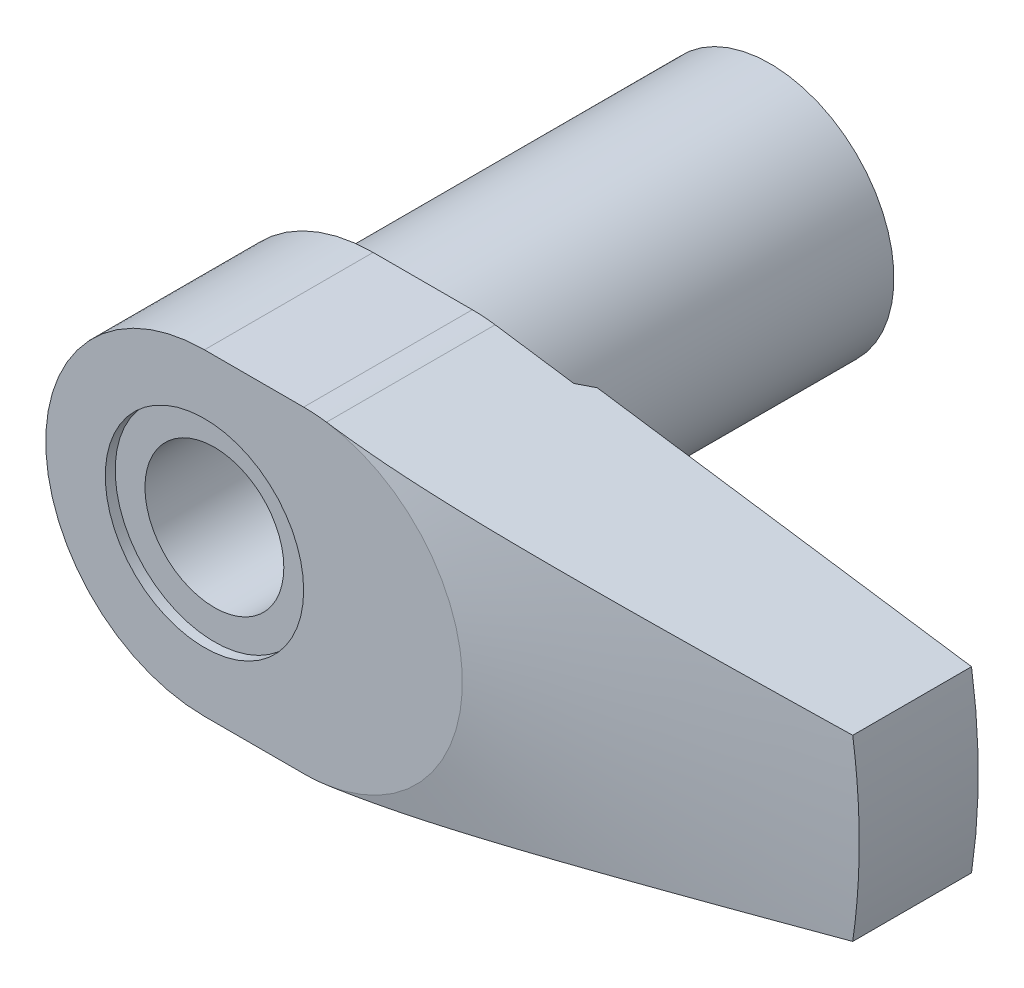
ISO-10303-21;
HEADER;
FILE_DESCRIPTION(('STEP AP214'),'2;1');
FILE_NAME('part.step','',(''),(''),'','','');
FILE_SCHEMA(('AUTOMOTIVE_DESIGN { 1 0 10303 214 1 1 1 1 }'));
ENDSEC;
DATA;
#1=APPLICATION_CONTEXT('core data for automotive mechanical design processes');
#2=APPLICATION_PROTOCOL_DEFINITION('international standard','automotive_design',2000,#1);
#3=PRODUCT_CONTEXT('',#1,'mechanical');
#4=PRODUCT('Part','Part','',(#3));
#5=PRODUCT_RELATED_PRODUCT_CATEGORY('part','',(#4));
#6=PRODUCT_DEFINITION_FORMATION('','',#4);
#7=PRODUCT_DEFINITION_CONTEXT('part definition',#1,'design');
#8=PRODUCT_DEFINITION('design','',#6,#7);
#9=PRODUCT_DEFINITION_SHAPE('','',#8);
#10=(LENGTH_UNIT() NAMED_UNIT(*) SI_UNIT(.MILLI.,.METRE.));
#11=(NAMED_UNIT(*) PLANE_ANGLE_UNIT() SI_UNIT($,.RADIAN.));
#12=(NAMED_UNIT(*) SI_UNIT($,.STERADIAN.) SOLID_ANGLE_UNIT());
#13=UNCERTAINTY_MEASURE_WITH_UNIT(LENGTH_MEASURE(1.E-05),#10,'distance_accuracy_value','');
#14=(GEOMETRIC_REPRESENTATION_CONTEXT(3) GLOBAL_UNCERTAINTY_ASSIGNED_CONTEXT((#13)) GLOBAL_UNIT_ASSIGNED_CONTEXT((#10,
#11,#12)) REPRESENTATION_CONTEXT('',''));
#15=CARTESIAN_POINT('',(0.,0.,0.));
#16=DIRECTION('',(0.,0.,1.));
#17=DIRECTION('',(1.,0.,0.));
#18=AXIS2_PLACEMENT_3D('',#15,#16,#17);
#19=CARTESIAN_POINT('',(59.3211597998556,9.,39.));
#20=DIRECTION('',(0.143824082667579,0.989603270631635,0.));
#21=DIRECTION('',(-0.989603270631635,0.143824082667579,0.));
#22=AXIS2_PLACEMENT_3D('',#19,#20,#21);
#23=PLANE('',#22);
#24=DIRECTION('',(0.,0.,1.));
#25=VECTOR('',#24,1.);
#26=CARTESIAN_POINT('',(12.3011853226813,15.8336523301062,39.));
#27=LINE('',#26,#25);
#28=CARTESIAN_POINT('',(12.3011853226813,15.8336523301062,40.));
#29=VERTEX_POINT('',#28);
#30=CARTESIAN_POINT('',(12.3011853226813,15.8336523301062,57.));
#31=VERTEX_POINT('',#30);
#32=EDGE_CURVE('E118',#29,#31,#27,.T.);
#33=ORIENTED_EDGE('',*,*,#32,.T.);
#34=CARTESIAN_POINT('',(12.3009853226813,15.8336813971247,56.9999999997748));
#35=CARTESIAN_POINT('',(12.6349091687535,15.785150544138,57.0000070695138));
#36=CARTESIAN_POINT('',(12.9688301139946,15.7366201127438,56.9981170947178));
#37=CARTESIAN_POINT('',(13.6366278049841,15.6395656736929,56.9905970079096));
#38=CARTESIAN_POINT('',(13.9705045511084,15.5910416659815,56.984966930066));
#39=CARTESIAN_POINT('',(14.9719359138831,15.4454985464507,56.9625492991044));
#40=CARTESIAN_POINT('',(15.6393758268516,15.3484961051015,56.9402343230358));
#41=CARTESIAN_POINT('',(16.9731230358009,15.1546558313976,56.8819118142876));
#42=CARTESIAN_POINT('',(17.6394308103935,15.0578179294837,56.8459151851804));
#43=CARTESIAN_POINT('',(18.9713017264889,14.8642503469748,56.7617059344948));
#44=CARTESIAN_POINT('',(19.6368648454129,14.7675206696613,56.7134929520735));
#45=CARTESIAN_POINT('',(20.9663767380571,14.5742959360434,56.6065704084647));
#46=CARTESIAN_POINT('',(21.6303264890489,14.4778007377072,56.5478731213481));
#47=CARTESIAN_POINT('',(22.9573852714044,14.2849325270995,56.4215740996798));
#48=CARTESIAN_POINT('',(23.6204943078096,14.1885595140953,56.3539724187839));
#49=CARTESIAN_POINT('',(24.9460835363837,13.9959048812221,56.211329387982));
#50=CARTESIAN_POINT('',(25.6085635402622,13.8996232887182,56.1362862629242));
#51=CARTESIAN_POINT('',(26.9328107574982,13.7071636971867,55.9800554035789));
#52=CARTESIAN_POINT('',(27.5945779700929,13.6109856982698,55.8988676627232));
#53=CARTESIAN_POINT('',(28.9051223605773,13.4205176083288,55.7329867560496));
#54=CARTESIAN_POINT('',(29.5539112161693,13.3262258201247,55.6483874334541));
#55=CARTESIAN_POINT('',(30.8509595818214,13.1377191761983,55.4751347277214));
#56=CARTESIAN_POINT('',(31.4992190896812,13.0435043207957,55.3864813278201));
#57=CARTESIAN_POINT('',(33.4433276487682,12.7609571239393,55.115496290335));
#58=CARTESIAN_POINT('',(34.7384906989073,12.572724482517,54.9281418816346));
#59=CARTESIAN_POINT('',(37.3274120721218,12.1964633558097,54.5440891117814));
#60=CARTESIAN_POINT('',(38.6211704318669,12.0084348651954,54.3473910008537));
#61=CARTESIAN_POINT('',(41.2076703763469,11.6325256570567,53.9472650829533));
#62=CARTESIAN_POINT('',(42.5004119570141,11.4446449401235,53.7438372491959));
#63=CARTESIAN_POINT('',(45.0880466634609,11.0685708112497,53.3315720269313));
#64=CARTESIAN_POINT('',(46.382938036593,10.8803776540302,53.1227234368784));
#65=CARTESIAN_POINT('',(48.9721284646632,10.5040774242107,52.7012905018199));
#66=CARTESIAN_POINT('',(50.2664275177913,10.3159703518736,52.4887061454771));
#67=CARTESIAN_POINT('',(52.8543782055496,9.93985029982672,52.0607120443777));
#68=CARTESIAN_POINT('',(54.1480299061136,9.75183731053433,51.8453027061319));
#69=CARTESIAN_POINT('',(56.7349541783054,9.37586643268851,51.4122210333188));
#70=CARTESIAN_POINT('',(58.0282267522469,9.1879085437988,51.1945487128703));
#71=CARTESIAN_POINT('',(59.3213597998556,8.99997093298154,50.9760395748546));
#72=B_SPLINE_CURVE_WITH_KNOTS('',3,(#34,#35,#36,#37,#38,#39,#40,#41,#42,#43,#44,#45,#46,#47,#48,
#49,#50,#51,#52,#53,#54,#55,#56,#57,#58,#59,#60,#61,#62,#63,#64,#65,#66,#67,#68,#69,#70,#71),
.UNSPECIFIED.,.F.,.F.,(4,2,2,2,2,2,2,2,2,2,2,2,2,2,2,2,2,2,4),(0.,1.01228518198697,
2.02456111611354,4.04885787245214,6.07154473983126,8.09429135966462,10.1146852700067,
12.1350670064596,14.1559318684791,16.1767988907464,18.1599062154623,20.1430217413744,
24.1093017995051,28.0754757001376,32.0416653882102,36.0168318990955,39.9920104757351,
43.9666231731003,47.9412110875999),.UNSPECIFIED.);
#73=CARTESIAN_POINT('',(59.3211597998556,9.,50.9760733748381));
#74=VERTEX_POINT('',#73);
#75=EDGE_CURVE('E96',#31,#74,#72,.T.);
#76=ORIENTED_EDGE('',*,*,#75,.T.);
#77=DIRECTION('',(0.,0.,1.));
#78=VECTOR('',#77,1.);
#79=CARTESIAN_POINT('',(59.3211597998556,9.,39.));
#80=LINE('',#79,#78);
#81=CARTESIAN_POINT('',(59.3211597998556,9.,39.));
#82=VERTEX_POINT('',#81);
#83=EDGE_CURVE('E124',#82,#74,#80,.T.);
#84=ORIENTED_EDGE('',*,*,#83,.F.);
#85=DIRECTION('',(-0.989603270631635,0.143824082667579,0.));
#86=VECTOR('',#85,1.);
#87=CARTESIAN_POINT('',(59.3211597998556,9.,39.));
#88=LINE('',#87,#86);
#89=CARTESIAN_POINT('',(21.592449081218,14.48330565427,39.));
#90=VERTEX_POINT('',#89);
#91=EDGE_CURVE('E139',#82,#90,#88,.T.);
#92=ORIENTED_EDGE('',*,*,#91,.T.);
#93=CARTESIAN_POINT('',(20.2354152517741,14.6805302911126,40.0002));
#94=CARTESIAN_POINT('',(20.349217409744,14.6639908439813,39.9177980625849));
#95=CARTESIAN_POINT('',(20.4628388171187,14.6474776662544,39.8351414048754));
#96=CARTESIAN_POINT('',(20.6897296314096,14.6145024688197,39.6693402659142));
#97=CARTESIAN_POINT('',(20.8029990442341,14.5980404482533,39.5861957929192));
#98=CARTESIAN_POINT('',(21.0291990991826,14.5651656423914,39.4194379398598));
#99=CARTESIAN_POINT('',(21.1421297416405,14.5487528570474,39.3358245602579));
#100=CARTESIAN_POINT('',(21.3676650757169,14.5159746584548,39.1681460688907));
#101=CARTESIAN_POINT('',(21.4802697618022,14.4996092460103,39.0840809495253));
#102=CARTESIAN_POINT('',(21.5927159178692,14.4832668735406,38.9998));
#103=B_SPLINE_CURVE_WITH_KNOTS('',3,(#93,#94,#95,#96,#97,#98,#99,#100,#101,#102),.UNSPECIFIED.,
.F.,.F.,(4,2,2,2,4),(0.,0.424418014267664,0.848828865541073,1.27323929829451,1.6976568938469),.UNSPECIFIED.);
#104=CARTESIAN_POINT('',(20.2356914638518,14.6804901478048,40.));
#105=VERTEX_POINT('',#104);
#106=EDGE_CURVE('E199',#105,#90,#103,.T.);
#107=ORIENTED_EDGE('',*,*,#106,.F.);
#108=DIRECTION('',(0.989603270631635,-0.143824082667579,0.));
#109=VECTOR('',#108,1.);
#110=CARTESIAN_POINT('',(12.3011853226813,15.8336523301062,40.));
#111=LINE('',#110,#109);
#112=EDGE_CURVE('E120',#29,#105,#111,.T.);
#113=ORIENTED_EDGE('',*,*,#112,.F.);
#114=EDGE_LOOP('',(#33,#76,#84,#92,#107,#113));
#115=FACE_BOUND('',#114,.T.);
#116=ADVANCED_FACE('F15',(#115),#23,.T.);
#117=CARTESIAN_POINT('',(59.3211597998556,-9.,39.));
#118=DIRECTION('',(0.143824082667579,-0.989603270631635,0.));
#119=DIRECTION('',(0.989603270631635,0.143824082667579,0.));
#120=AXIS2_PLACEMENT_3D('',#117,#118,#119);
#121=PLANE('',#120);
#122=DIRECTION('',(0.,0.,1.));
#123=VECTOR('',#122,1.);
#124=CARTESIAN_POINT('',(59.3211597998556,-9.,39.));
#125=LINE('',#124,#123);
#126=CARTESIAN_POINT('',(59.3211597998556,-9.,39.));
#127=VERTEX_POINT('',#126);
#128=CARTESIAN_POINT('',(59.3211597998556,-9.,50.9760733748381));
#129=VERTEX_POINT('',#128);
#130=EDGE_CURVE('E146',#127,#129,#125,.T.);
#131=ORIENTED_EDGE('',*,*,#130,.T.);
#132=CARTESIAN_POINT('',(59.3213597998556,-8.99997093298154,50.9760395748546));
#133=CARTESIAN_POINT('',(58.3469494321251,-9.14158695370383,51.1407059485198));
#134=CARTESIAN_POINT('',(57.3724576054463,-9.2832148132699,51.3048819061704));
#135=CARTESIAN_POINT('',(55.4232742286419,-9.56649955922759,51.6320245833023));
#136=CARTESIAN_POINT('',(54.4485826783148,-9.7081564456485,51.7949913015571));
#137=CARTESIAN_POINT('',(52.4991016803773,-9.99148444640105,52.1194640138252));
#138=CARTESIAN_POINT('',(51.5243122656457,-10.1331555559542,52.2809702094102));
#139=CARTESIAN_POINT('',(49.5744519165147,-10.4165386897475,52.6022387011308));
#140=CARTESIAN_POINT('',(48.5993809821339,-10.5582507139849,52.7620009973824));
#141=CARTESIAN_POINT('',(46.6499435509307,-10.8415723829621,53.0792219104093));
#142=CARTESIAN_POINT('',(45.6755774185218,-10.9831819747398,53.2366828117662));
#143=CARTESIAN_POINT('',(43.7264316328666,-11.2664612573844,53.5489681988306));
#144=CARTESIAN_POINT('',(42.7516519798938,-11.4081309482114,53.7037926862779));
#145=CARTESIAN_POINT('',(40.8014288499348,-11.6915668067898,54.0101609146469));
#146=CARTESIAN_POINT('',(39.8259852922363,-11.8333329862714,54.1617041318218));
#147=CARTESIAN_POINT('',(37.8744646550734,-12.116957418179,54.4605909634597));
#148=CARTESIAN_POINT('',(36.8983875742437,-12.2588156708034,54.6079345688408));
#149=CARTESIAN_POINT('',(34.943686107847,-12.5429023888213,54.8974748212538));
#150=CARTESIAN_POINT('',(33.9650603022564,-12.685131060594,55.0396617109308));
#151=CARTESIAN_POINT('',(32.0068268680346,-12.9697310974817,55.3169515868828));
#152=CARTESIAN_POINT('',(31.0272192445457,-13.1121024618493,55.4520546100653));
#153=CARTESIAN_POINT('',(29.0671415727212,-13.3969705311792,55.7128637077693));
#154=CARTESIAN_POINT('',(28.0866719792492,-13.5394671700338,55.8385732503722));
#155=CARTESIAN_POINT('',(26.124206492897,-13.8246822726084,56.077581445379));
#156=CARTESIAN_POINT('',(25.1422105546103,-13.9674007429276,56.1908797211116));
#157=CARTESIAN_POINT('',(23.1751165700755,-14.2532885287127,56.4011544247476));
#158=CARTESIAN_POINT('',(22.1900161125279,-14.3964581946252,56.4981080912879));
#159=CARTESIAN_POINT('',(20.2180167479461,-14.6830589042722,56.670441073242));
#160=CARTESIAN_POINT('',(19.2311180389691,-14.8264899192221,56.7458226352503));
#161=CARTESIAN_POINT('',(17.7489059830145,-15.0419073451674,56.8386947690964));
#162=CARTESIAN_POINT('',(17.2542067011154,-15.1138045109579,56.8662966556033));
#163=CARTESIAN_POINT('',(16.2644594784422,-15.2576495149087,56.9141314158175));
#164=CARTESIAN_POINT('',(15.7694115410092,-15.3295973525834,56.9343643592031));
#165=CARTESIAN_POINT('',(14.7788777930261,-15.4735566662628,56.9669554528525));
#166=CARTESIAN_POINT('',(14.2833918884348,-15.5455681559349,56.9793107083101));
#167=CARTESIAN_POINT('',(13.2922673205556,-15.6896133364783,56.9958528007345));
#168=CARTESIAN_POINT('',(12.7966286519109,-15.7616470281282,57.0000393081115));
#169=CARTESIAN_POINT('',(12.3009853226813,-15.8336813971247,56.9999999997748));
#170=B_SPLINE_CURVE_WITH_KNOTS('',3,(#132,#133,#134,#135,#136,#137,#138,#139,#140,#141,#142,
#143,#144,#145,#146,#147,#148,#149,#150,#151,#152,#153,#154,#155,#156,#157,#158,#159,#160,#161,
#162,#163,#164,#165,#166,#167,#168,#169),.UNSPECIFIED.,.F.,.F.,(4,2,2,2,2,2,2,2,2,2,2,2,2,2,2,2,
2,2,4),(0.,2.99496460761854,5.98993225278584,8.98448004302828,11.9790276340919,14.9703671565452,
17.9617047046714,20.9535162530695,23.9453342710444,26.9425456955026,29.9397415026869,
32.935825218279,35.9319998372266,38.9323130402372,41.9323136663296,43.4342420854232,
44.9361563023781,46.4386221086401,47.9411485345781),.UNSPECIFIED.);
#171=CARTESIAN_POINT('',(12.3011853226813,-15.8336523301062,57.));
#172=VERTEX_POINT('',#171);
#173=EDGE_CURVE('E36',#129,#172,#170,.T.);
#174=ORIENTED_EDGE('',*,*,#173,.T.);
#175=DIRECTION('',(0.,0.,1.));
#176=VECTOR('',#175,1.);
#177=CARTESIAN_POINT('',(12.3011853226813,-15.8336523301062,39.));
#178=LINE('',#177,#176);
#179=CARTESIAN_POINT('',(12.3011853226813,-15.8336523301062,40.));
#180=VERTEX_POINT('',#179);
#181=EDGE_CURVE('E149',#180,#172,#178,.T.);
#182=ORIENTED_EDGE('',*,*,#181,.F.);
#183=DIRECTION('',(-0.989603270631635,-0.143824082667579,0.));
#184=VECTOR('',#183,1.);
#185=CARTESIAN_POINT('',(20.2356914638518,-14.6804901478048,40.));
#186=LINE('',#185,#184);
#187=CARTESIAN_POINT('',(20.2356914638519,-14.6804901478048,40.));
#188=VERTEX_POINT('',#187);
#189=EDGE_CURVE('E225',#188,#180,#186,.T.);
#190=ORIENTED_EDGE('',*,*,#189,.F.);
#191=CARTESIAN_POINT('',(21.5927159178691,-14.4832668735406,38.9998));
#192=CARTESIAN_POINT('',(21.4802697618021,-14.4996092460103,39.0840809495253));
#193=CARTESIAN_POINT('',(21.3676650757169,-14.5159746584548,39.1681460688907));
#194=CARTESIAN_POINT('',(21.1421297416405,-14.5487528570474,39.3358245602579));
#195=CARTESIAN_POINT('',(21.0291990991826,-14.5651656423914,39.4194379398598));
#196=CARTESIAN_POINT('',(20.8029990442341,-14.5980404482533,39.5861957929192));
#197=CARTESIAN_POINT('',(20.6897296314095,-14.6145024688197,39.6693402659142));
#198=CARTESIAN_POINT('',(20.4628388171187,-14.6474776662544,39.8351414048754));
#199=CARTESIAN_POINT('',(20.349217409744,-14.6639908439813,39.9177980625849));
#200=CARTESIAN_POINT('',(20.2354152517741,-14.6805302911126,40.0002));
#201=B_SPLINE_CURVE_WITH_KNOTS('',3,(#191,#192,#193,#194,#195,#196,#197,#198,#199,#200),
.UNSPECIFIED.,.F.,.F.,(4,2,2,2,4),(0.,0.424417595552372,0.848828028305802,1.27323887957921,
1.69765689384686),.UNSPECIFIED.);
#202=CARTESIAN_POINT('',(21.592449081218,-14.48330565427,39.));
#203=VERTEX_POINT('',#202);
#204=EDGE_CURVE('E29',#203,#188,#201,.T.);
#205=ORIENTED_EDGE('',*,*,#204,.F.);
#206=DIRECTION('',(0.989603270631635,0.143824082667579,0.));
#207=VECTOR('',#206,1.);
#208=CARTESIAN_POINT('',(59.3211597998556,-9.,39.));
#209=LINE('',#208,#207);
#210=EDGE_CURVE('E143',#203,#127,#209,.T.);
#211=ORIENTED_EDGE('',*,*,#210,.T.);
#212=EDGE_LOOP('',(#131,#174,#182,#190,#205,#211));
#213=FACE_BOUND('',#212,.T.);
#214=ADVANCED_FACE('F187',(#213),#121,.T.);
#215=CARTESIAN_POINT('',(0.,0.,57.));
#216=DIRECTION('',(0.,0.,1.));
#217=DIRECTION('',(1.,0.,0.));
#218=AXIS2_PLACEMENT_3D('',#215,#216,#217);
#219=PLANE('',#218);
#220=CARTESIAN_POINT('',(0.,0.,57.));
#221=DIRECTION('',(0.,0.,1.));
#222=DIRECTION('',(1.,0.,0.));
#223=AXIS2_PLACEMENT_3D('',#220,#221,#222);
#224=CIRCLE('',#223,10.);
#225=CARTESIAN_POINT('',(10.,0.,57.));
#226=VERTEX_POINT('',#225);
#227=EDGE_CURVE('E123',#226,#226,#224,.T.);
#228=ORIENTED_EDGE('',*,*,#227,.F.);
#229=EDGE_LOOP('',(#228));
#230=FACE_BOUND('',#229,.T.);
#231=CARTESIAN_POINT('',(10.,0.,57.));
#232=DIRECTION('',(0.,0.,1.));
#233=DIRECTION('',(1.,0.,0.));
#234=AXIS2_PLACEMENT_3D('',#231,#232,#233);
#235=CIRCLE('',#234,16.);
#236=CARTESIAN_POINT('',(10.,-16.,57.));
#237=VERTEX_POINT('',#236);
#238=EDGE_CURVE('E114',#237,#172,#235,.T.);
#239=ORIENTED_EDGE('',*,*,#238,.T.);
#240=CARTESIAN_POINT('',(10.,0.,57.));
#241=DIRECTION('',(0.,0.,-1.));
#242=DIRECTION('',(-1.,0.,0.));
#243=AXIS2_PLACEMENT_3D('',#240,#241,#242);
#244=CIRCLE('',#243,16.);
#245=EDGE_CURVE('E99',#31,#172,#244,.T.);
#246=ORIENTED_EDGE('',*,*,#245,.F.);
#247=CARTESIAN_POINT('',(10.,0.,57.));
#248=DIRECTION('',(0.,0.,1.));
#249=DIRECTION('',(1.,0.,0.));
#250=AXIS2_PLACEMENT_3D('',#247,#248,#249);
#251=CIRCLE('',#250,16.);
#252=CARTESIAN_POINT('',(10.,16.,57.));
#253=VERTEX_POINT('',#252);
#254=EDGE_CURVE('E111',#31,#253,#251,.T.);
#255=ORIENTED_EDGE('',*,*,#254,.T.);
#256=DIRECTION('',(-1.,0.,0.));
#257=VECTOR('',#256,1.);
#258=CARTESIAN_POINT('',(0.,16.,57.));
#259=LINE('',#258,#257);
#260=CARTESIAN_POINT('',(0.,16.,57.));
#261=VERTEX_POINT('',#260);
#262=EDGE_CURVE('E130',#253,#261,#259,.T.);
#263=ORIENTED_EDGE('',*,*,#262,.T.);
#264=CARTESIAN_POINT('',(0.,0.,57.));
#265=DIRECTION('',(0.,0.,1.));
#266=DIRECTION('',(1.,0.,0.));
#267=AXIS2_PLACEMENT_3D('',#264,#265,#266);
#268=CIRCLE('',#267,16.);
#269=CARTESIAN_POINT('',(1.6759120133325E-13,-16.,57.));
#270=VERTEX_POINT('',#269);
#271=EDGE_CURVE('E177',#261,#270,#268,.T.);
#272=ORIENTED_EDGE('',*,*,#271,.T.);
#273=DIRECTION('',(1.,0.,0.));
#274=VECTOR('',#273,1.);
#275=CARTESIAN_POINT('',(1.6759120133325E-13,-16.,57.));
#276=LINE('',#275,#274);
#277=EDGE_CURVE('E133',#270,#237,#276,.T.);
#278=ORIENTED_EDGE('',*,*,#277,.T.);
#279=EDGE_LOOP('',(#239,#246,#255,#263,#272,#278));
#280=FACE_BOUND('',#279,.T.);
#281=ADVANCED_FACE('F108',(#230,#280),#219,.T.);
#282=CARTESIAN_POINT('',(0.,0.,39.));
#283=DIRECTION('',(0.,0.,1.));
#284=DIRECTION('',(1.,0.,0.));
#285=AXIS2_PLACEMENT_3D('',#282,#283,#284);
#286=CYLINDRICAL_SURFACE('',#285,60.);
#287=ORIENTED_EDGE('',*,*,#83,.T.);
#288=CARTESIAN_POINT('',(59.3211294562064,9.0002,50.9760723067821));
#289=CARTESIAN_POINT('',(59.4343867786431,8.25371603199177,50.9800589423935));
#290=CARTESIAN_POINT('',(59.5335412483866,7.50515703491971,50.9835515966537));
#291=CARTESIAN_POINT('',(59.7035346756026,6.00482909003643,50.9895421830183));
#292=CARTESIAN_POINT('',(59.7743737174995,5.25306015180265,50.9920401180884));
#293=CARTESIAN_POINT('',(59.9435951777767,3.00309994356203,50.9980085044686));
#294=CARTESIAN_POINT('',(60.,1.50154997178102,51.));
#295=CARTESIAN_POINT('',(60.,-1.50154997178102,51.));
#296=CARTESIAN_POINT('',(59.9435951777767,-3.00309994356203,50.9980085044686));
#297=CARTESIAN_POINT('',(59.7743737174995,-5.25306015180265,50.9920401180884));
#298=CARTESIAN_POINT('',(59.7035346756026,-6.00482909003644,50.9895421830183));
#299=CARTESIAN_POINT('',(59.5335412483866,-7.50515703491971,50.9835515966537));
#300=CARTESIAN_POINT('',(59.4343867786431,-8.25371603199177,50.9800589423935));
#301=CARTESIAN_POINT('',(59.3211294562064,-9.0002,50.9760723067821));
#302=B_SPLINE_CURVE_WITH_KNOTS('',3,(#288,#289,#290,#291,#292,#293,#294,#295,#296,#297,#298,
#299,#300,#301),.UNSPECIFIED.,.F.,.F.,(4,2,2,2,2,2,4),(0.,2.26484454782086,4.52968234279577,
9.03301255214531,13.5363427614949,15.8011805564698,18.0660251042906),.UNSPECIFIED.);
#303=EDGE_CURVE('E9',#74,#129,#302,.T.);
#304=ORIENTED_EDGE('',*,*,#303,.T.);
#305=ORIENTED_EDGE('',*,*,#130,.F.);
#306=CARTESIAN_POINT('',(0.,0.,39.));
#307=DIRECTION('',(0.,0.,1.));
#308=DIRECTION('',(1.,0.,0.));
#309=AXIS2_PLACEMENT_3D('',#306,#307,#308);
#310=CIRCLE('',#309,60.);
#311=EDGE_CURVE('E241',#127,#82,#310,.T.);
#312=ORIENTED_EDGE('',*,*,#311,.T.);
#313=EDGE_LOOP('',(#287,#304,#305,#312));
#314=FACE_BOUND('',#313,.T.);
#315=ADVANCED_FACE('F210',(#314),#286,.T.);
#316=CARTESIAN_POINT('',(10.,0.,39.));
#317=DIRECTION('',(0.,0.,1.));
#318=DIRECTION('',(1.,0.,0.));
#319=AXIS2_PLACEMENT_3D('',#316,#317,#318);
#320=CYLINDRICAL_SURFACE('',#319,16.);
#321=ORIENTED_EDGE('',*,*,#32,.F.);
#322=CARTESIAN_POINT('',(10.,0.,40.));
#323=DIRECTION('',(0.,0.,-1.));
#324=DIRECTION('',(-1.,0.,0.));
#325=AXIS2_PLACEMENT_3D('',#322,#323,#324);
#326=CIRCLE('',#325,16.);
#327=CARTESIAN_POINT('',(10.,16.,40.));
#328=VERTEX_POINT('',#327);
#329=EDGE_CURVE('E103',#328,#29,#326,.T.);
#330=ORIENTED_EDGE('',*,*,#329,.F.);
#331=DIRECTION('',(0.,0.,1.));
#332=VECTOR('',#331,1.);
#333=CARTESIAN_POINT('',(10.,16.,39.));
#334=LINE('',#333,#332);
#335=EDGE_CURVE('E128',#328,#253,#334,.T.);
#336=ORIENTED_EDGE('',*,*,#335,.T.);
#337=ORIENTED_EDGE('',*,*,#254,.F.);
#338=EDGE_LOOP('',(#321,#330,#336,#337));
#339=FACE_BOUND('',#338,.T.);
#340=ADVANCED_FACE('F126',(#339),#320,.T.);
#341=CARTESIAN_POINT('',(10.,0.,39.));
#342=DIRECTION('',(0.,0.,1.));
#343=DIRECTION('',(1.,0.,0.));
#344=AXIS2_PLACEMENT_3D('',#341,#342,#343);
#345=CYLINDRICAL_SURFACE('',#344,16.);
#346=DIRECTION('',(0.,0.,1.));
#347=VECTOR('',#346,1.);
#348=CARTESIAN_POINT('',(10.,-16.,39.));
#349=LINE('',#348,#347);
#350=CARTESIAN_POINT('',(10.,-16.,40.));
#351=VERTEX_POINT('',#350);
#352=EDGE_CURVE('E152',#351,#237,#349,.T.);
#353=ORIENTED_EDGE('',*,*,#352,.F.);
#354=CARTESIAN_POINT('',(10.,0.,40.));
#355=DIRECTION('',(0.,0.,-1.));
#356=DIRECTION('',(-1.,0.,0.));
#357=AXIS2_PLACEMENT_3D('',#354,#355,#356);
#358=CIRCLE('',#357,16.);
#359=EDGE_CURVE('E227',#180,#351,#358,.T.);
#360=ORIENTED_EDGE('',*,*,#359,.F.);
#361=ORIENTED_EDGE('',*,*,#181,.T.);
#362=ORIENTED_EDGE('',*,*,#238,.F.);
#363=EDGE_LOOP('',(#353,#360,#361,#362));
#364=FACE_BOUND('',#363,.T.);
#365=ADVANCED_FACE('F329',(#364),#345,.T.);
#366=CARTESIAN_POINT('',(1.6759120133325E-13,-16.,39.));
#367=DIRECTION('',(0.,-1.,0.));
#368=DIRECTION('',(1.,0.,0.));
#369=AXIS2_PLACEMENT_3D('',#366,#367,#368);
#370=PLANE('',#369);
#371=DIRECTION('',(0.,0.,1.));
#372=VECTOR('',#371,1.);
#373=CARTESIAN_POINT('',(1.6759120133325E-13,-16.,39.));
#374=LINE('',#373,#372);
#375=CARTESIAN_POINT('',(1.05471187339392E-13,-16.,40.));
#376=VERTEX_POINT('',#375);
#377=EDGE_CURVE('E154',#376,#270,#374,.T.);
#378=ORIENTED_EDGE('',*,*,#377,.F.);
#379=DIRECTION('',(-1.,0.,0.));
#380=VECTOR('',#379,1.);
#381=CARTESIAN_POINT('',(10.,-16.,40.));
#382=LINE('',#381,#380);
#383=EDGE_CURVE('E229',#351,#376,#382,.T.);
#384=ORIENTED_EDGE('',*,*,#383,.F.);
#385=ORIENTED_EDGE('',*,*,#352,.T.);
#386=ORIENTED_EDGE('',*,*,#277,.F.);
#387=EDGE_LOOP('',(#378,#384,#385,#386));
#388=FACE_BOUND('',#387,.T.);
#389=ADVANCED_FACE('F325',(#388),#370,.T.);
#390=CARTESIAN_POINT('',(0.,16.,39.));
#391=DIRECTION('',(0.,1.,0.));
#392=DIRECTION('',(-1.,0.,0.));
#393=AXIS2_PLACEMENT_3D('',#390,#391,#392);
#394=PLANE('',#393);
#395=ORIENTED_EDGE('',*,*,#335,.F.);
#396=DIRECTION('',(1.,0.,0.));
#397=VECTOR('',#396,1.);
#398=CARTESIAN_POINT('',(1.05601725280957E-13,16.,40.));
#399=LINE('',#398,#397);
#400=CARTESIAN_POINT('',(1.05601725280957E-13,16.,40.));
#401=VERTEX_POINT('',#400);
#402=EDGE_CURVE('E231',#401,#328,#399,.T.);
#403=ORIENTED_EDGE('',*,*,#402,.F.);
#404=DIRECTION('',(0.,0.,1.));
#405=VECTOR('',#404,1.);
#406=CARTESIAN_POINT('',(0.,16.,39.));
#407=LINE('',#406,#405);
#408=EDGE_CURVE('E156',#401,#261,#407,.T.);
#409=ORIENTED_EDGE('',*,*,#408,.T.);
#410=ORIENTED_EDGE('',*,*,#262,.F.);
#411=EDGE_LOOP('',(#395,#403,#409,#410));
#412=FACE_BOUND('',#411,.T.);
#413=ADVANCED_FACE('F259',(#412),#394,.T.);
#414=CARTESIAN_POINT('',(0.,0.,57.));
#415=DIRECTION('',(0.,0.,-1.));
#416=DIRECTION('',(-1.,0.,0.));
#417=AXIS2_PLACEMENT_3D('',#414,#415,#416);
#418=CYLINDRICAL_SURFACE('',#417,16.);
#419=CARTESIAN_POINT('',(0.,0.,40.));
#420=DIRECTION('',(0.,0.,1.));
#421=DIRECTION('',(1.,0.,0.));
#422=AXIS2_PLACEMENT_3D('',#419,#420,#421);
#423=CIRCLE('',#422,16.);
#424=EDGE_CURVE('E136',#401,#376,#423,.T.);
#425=ORIENTED_EDGE('',*,*,#424,.T.);
#426=ORIENTED_EDGE('',*,*,#377,.T.);
#427=ORIENTED_EDGE('',*,*,#271,.F.);
#428=ORIENTED_EDGE('',*,*,#408,.F.);
#429=EDGE_LOOP('',(#425,#426,#427,#428));
#430=FACE_BOUND('',#429,.T.);
#431=ADVANCED_FACE('F17',(#430),#418,.T.);
#432=CARTESIAN_POINT('',(70.,20.,39.));
#433=DIRECTION('',(0.,0.,1.));
#434=DIRECTION('',(1.,0.,0.));
#435=AXIS2_PLACEMENT_3D('',#432,#433,#434);
#436=PLANE('',#435);
#437=ORIENTED_EDGE('',*,*,#210,.F.);
#438=CARTESIAN_POINT('',(0.,0.,39.));
#439=DIRECTION('',(0.,0.,1.));
#440=DIRECTION('',(1.,0.,0.));
#441=AXIS2_PLACEMENT_3D('',#438,#439,#440);
#442=CIRCLE('',#441,26.);
#443=EDGE_CURVE('E43',#203,#90,#442,.T.);
#444=ORIENTED_EDGE('',*,*,#443,.T.);
#445=ORIENTED_EDGE('',*,*,#91,.F.);
#446=ORIENTED_EDGE('',*,*,#311,.F.);
#447=EDGE_LOOP('',(#437,#444,#445,#446));
#448=FACE_BOUND('',#447,.T.);
#449=ADVANCED_FACE('F246',(#448),#436,.F.);
#450=CARTESIAN_POINT('',(0.,0.,0.));
#451=DIRECTION('',(0.,0.,-1.));
#452=DIRECTION('',(-1.,0.,0.));
#453=AXIS2_PLACEMENT_3D('',#450,#451,#452);
#454=CYLINDRICAL_SURFACE('',#453,7.);
#455=CARTESIAN_POINT('',(0.,0.,34.));
#456=DIRECTION('',(0.,0.,-1.));
#457=DIRECTION('',(-1.,0.,0.));
#458=AXIS2_PLACEMENT_3D('',#455,#456,#457);
#459=CIRCLE('',#458,7.);
#460=CARTESIAN_POINT('',(-7.,0.,34.));
#461=VERTEX_POINT('',#460);
#462=EDGE_CURVE('E171',#461,#461,#459,.T.);
#463=ORIENTED_EDGE('',*,*,#462,.T.);
#464=EDGE_LOOP('',(#463));
#465=FACE_BOUND('',#464,.T.);
#466=CARTESIAN_POINT('',(0.,0.,56.));
#467=DIRECTION('',(0.,0.,1.));
#468=DIRECTION('',(1.,0.,0.));
#469=AXIS2_PLACEMENT_3D('',#466,#467,#468);
#470=CIRCLE('',#469,7.);
#471=CARTESIAN_POINT('',(7.,0.,56.));
#472=VERTEX_POINT('',#471);
#473=EDGE_CURVE('E162',#472,#472,#470,.T.);
#474=ORIENTED_EDGE('',*,*,#473,.T.);
#475=EDGE_LOOP('',(#474));
#476=FACE_BOUND('',#475,.T.);
#477=ADVANCED_FACE('F248',(#465,#476),#454,.F.);
#478=CARTESIAN_POINT('',(0.,0.,0.));
#479=DIRECTION('',(0.,0.,1.));
#480=DIRECTION('',(1.,0.,0.));
#481=AXIS2_PLACEMENT_3D('',#478,#479,#480);
#482=PLANE('',#481);
#483=CARTESIAN_POINT('',(0.,0.,0.));
#484=DIRECTION('',(0.,0.,-1.));
#485=DIRECTION('',(-1.,0.,0.));
#486=AXIS2_PLACEMENT_3D('',#483,#484,#485);
#487=CIRCLE('',#486,12.5);
#488=CARTESIAN_POINT('',(-12.5,0.,0.));
#489=VERTEX_POINT('',#488);
#490=EDGE_CURVE('E174',#489,#489,#487,.T.);
#491=ORIENTED_EDGE('',*,*,#490,.T.);
#492=EDGE_LOOP('',(#491));
#493=FACE_BOUND('',#492,.T.);
#494=CARTESIAN_POINT('',(0.,0.,0.));
#495=DIRECTION('',(0.,0.,-1.));
#496=DIRECTION('',(-1.,0.,0.));
#497=AXIS2_PLACEMENT_3D('',#494,#495,#496);
#498=CIRCLE('',#497,9.5);
#499=CARTESIAN_POINT('',(-9.5,0.,0.));
#500=VERTEX_POINT('',#499);
#501=EDGE_CURVE('E165',#500,#500,#498,.T.);
#502=ORIENTED_EDGE('',*,*,#501,.F.);
#503=EDGE_LOOP('',(#502));
#504=FACE_BOUND('',#503,.T.);
#505=ADVANCED_FACE('F256',(#493,#504),#482,.F.);
#506=CARTESIAN_POINT('',(0.,0.,39.));
#507=DIRECTION('',(0.,0.,-1.));
#508=DIRECTION('',(-1.,0.,0.));
#509=AXIS2_PLACEMENT_3D('',#506,#507,#508);
#510=CYLINDRICAL_SURFACE('',#509,12.5);
#511=ORIENTED_EDGE('',*,*,#490,.F.);
#512=EDGE_LOOP('',(#511));
#513=FACE_BOUND('',#512,.T.);
#514=CARTESIAN_POINT('',(0.,0.,40.));
#515=DIRECTION('',(0.,0.,1.));
#516=DIRECTION('',(1.,0.,0.));
#517=AXIS2_PLACEMENT_3D('',#514,#515,#516);
#518=CIRCLE('',#517,12.5);
#519=CARTESIAN_POINT('',(12.5,0.,40.));
#520=VERTEX_POINT('',#519);
#521=EDGE_CURVE('E131',#520,#520,#518,.T.);
#522=ORIENTED_EDGE('',*,*,#521,.F.);
#523=EDGE_LOOP('',(#522));
#524=FACE_BOUND('',#523,.T.);
#525=ADVANCED_FACE('F263',(#513,#524),#510,.T.);
#526=CARTESIAN_POINT('',(7.,0.,34.));
#527=DIRECTION('',(0.,0.,-1.));
#528=DIRECTION('',(-1.,0.,0.));
#529=AXIS2_PLACEMENT_3D('',#526,#527,#528);
#530=PLANE('',#529);
#531=CARTESIAN_POINT('',(0.,0.,34.));
#532=DIRECTION('',(0.,0.,-1.));
#533=DIRECTION('',(-1.,0.,0.));
#534=AXIS2_PLACEMENT_3D('',#531,#532,#533);
#535=CIRCLE('',#534,9.5);
#536=CARTESIAN_POINT('',(-9.5,0.,34.));
#537=VERTEX_POINT('',#536);
#538=EDGE_CURVE('E168',#537,#537,#535,.T.);
#539=ORIENTED_EDGE('',*,*,#538,.T.);
#540=EDGE_LOOP('',(#539));
#541=FACE_BOUND('',#540,.T.);
#542=ORIENTED_EDGE('',*,*,#462,.F.);
#543=EDGE_LOOP('',(#542));
#544=FACE_BOUND('',#543,.T.);
#545=ADVANCED_FACE('F288',(#541,#544),#530,.T.);
#546=CARTESIAN_POINT('',(0.,0.,0.));
#547=DIRECTION('',(0.,0.,-1.));
#548=DIRECTION('',(-1.,0.,0.));
#549=AXIS2_PLACEMENT_3D('',#546,#547,#548);
#550=CYLINDRICAL_SURFACE('',#549,9.5);
#551=ORIENTED_EDGE('',*,*,#501,.T.);
#552=EDGE_LOOP('',(#551));
#553=FACE_BOUND('',#552,.T.);
#554=ORIENTED_EDGE('',*,*,#538,.F.);
#555=EDGE_LOOP('',(#554));
#556=FACE_BOUND('',#555,.T.);
#557=ADVANCED_FACE('F278',(#553,#556),#550,.F.);
#558=CARTESIAN_POINT('',(0.,0.,56.));
#559=DIRECTION('',(0.,0.,1.));
#560=DIRECTION('',(1.,0.,0.));
#561=AXIS2_PLACEMENT_3D('',#558,#559,#560);
#562=CYLINDRICAL_SURFACE('',#561,10.);
#563=CARTESIAN_POINT('',(0.,0.,56.));
#564=DIRECTION('',(0.,0.,1.));
#565=DIRECTION('',(1.,0.,0.));
#566=AXIS2_PLACEMENT_3D('',#563,#564,#565);
#567=CIRCLE('',#566,10.);
#568=CARTESIAN_POINT('',(10.,0.,56.));
#569=VERTEX_POINT('',#568);
#570=EDGE_CURVE('E159',#569,#569,#567,.T.);
#571=ORIENTED_EDGE('',*,*,#570,.F.);
#572=EDGE_LOOP('',(#571));
#573=FACE_BOUND('',#572,.T.);
#574=ORIENTED_EDGE('',*,*,#227,.T.);
#575=EDGE_LOOP('',(#574));
#576=FACE_BOUND('',#575,.T.);
#577=ADVANCED_FACE('F275',(#573,#576),#562,.F.);
#578=CARTESIAN_POINT('',(0.,0.,56.));
#579=DIRECTION('',(0.,0.,1.));
#580=DIRECTION('',(1.,0.,0.));
#581=AXIS2_PLACEMENT_3D('',#578,#579,#580);
#582=PLANE('',#581);
#583=ORIENTED_EDGE('',*,*,#473,.F.);
#584=EDGE_LOOP('',(#583));
#585=FACE_BOUND('',#584,.T.);
#586=ORIENTED_EDGE('',*,*,#570,.T.);
#587=EDGE_LOOP('',(#586));
#588=FACE_BOUND('',#587,.T.);
#589=ADVANCED_FACE('F277',(#585,#588),#582,.T.);
#590=CARTESIAN_POINT('',(-12.5,0.,40.));
#591=DIRECTION('',(0.,0.,-1.));
#592=DIRECTION('',(-1.,0.,0.));
#593=AXIS2_PLACEMENT_3D('',#590,#591,#592);
#594=PLANE('',#593);
#595=ORIENTED_EDGE('',*,*,#521,.T.);
#596=EDGE_LOOP('',(#595));
#597=FACE_BOUND('',#596,.T.);
#598=ORIENTED_EDGE('',*,*,#424,.F.);
#599=ORIENTED_EDGE('',*,*,#402,.T.);
#600=ORIENTED_EDGE('',*,*,#329,.T.);
#601=ORIENTED_EDGE('',*,*,#112,.T.);
#602=CARTESIAN_POINT('',(0.,0.,40.));
#603=DIRECTION('',(0.,0.,1.));
#604=DIRECTION('',(1.,0.,0.));
#605=AXIS2_PLACEMENT_3D('',#602,#603,#604);
#606=CIRCLE('',#605,25.);
#607=EDGE_CURVE('E206',#188,#105,#606,.T.);
#608=ORIENTED_EDGE('',*,*,#607,.F.);
#609=ORIENTED_EDGE('',*,*,#189,.T.);
#610=ORIENTED_EDGE('',*,*,#359,.T.);
#611=ORIENTED_EDGE('',*,*,#383,.T.);
#612=EDGE_LOOP('',(#598,#599,#600,#601,#608,#609,#610,#611));
#613=FACE_BOUND('',#612,.T.);
#614=ADVANCED_FACE('F194',(#597,#613),#594,.T.);
#615=CARTESIAN_POINT('',(0.,0.,40.));
#616=DIRECTION('',(0.,0.,-1.));
#617=DIRECTION('',(-1.,0.,0.));
#618=AXIS2_PLACEMENT_3D('',#615,#616,#617);
#619=CONICAL_SURFACE('',#618,25.,0.785398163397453);
#620=ORIENTED_EDGE('',*,*,#106,.T.);
#621=ORIENTED_EDGE('',*,*,#443,.F.);
#622=ORIENTED_EDGE('',*,*,#204,.T.);
#623=ORIENTED_EDGE('',*,*,#607,.T.);
#624=EDGE_LOOP('',(#620,#621,#622,#623));
#625=FACE_BOUND('',#624,.T.);
#626=ADVANCED_FACE('F190',(#625),#619,.F.);
#627=CARTESIAN_POINT('',(10.,0.,49.325624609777));
#628=DIRECTION('',(0.,0.,-1.));
#629=DIRECTION('',(-1.,0.,0.));
#630=AXIS2_PLACEMENT_3D('',#627,#628,#629);
#631=CONICAL_SURFACE('',#630,59.4881272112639,1.39612412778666);
#632=ORIENTED_EDGE('',*,*,#245,.T.);
#633=ORIENTED_EDGE('',*,*,#173,.F.);
#634=ORIENTED_EDGE('',*,*,#303,.F.);
#635=ORIENTED_EDGE('',*,*,#75,.F.);
#636=EDGE_LOOP('',(#632,#633,#634,#635));
#637=FACE_BOUND('',#636,.T.);
#638=ADVANCED_FACE('F98',(#637),#631,.T.);
#639=CLOSED_SHELL('',(#116,#214,#281,#315,#340,#365,#389,#413,#431,#449,#477,#505,#525,#545,
#557,#577,#589,#614,#626,#638));
#640=MANIFOLD_SOLID_BREP('B1',#639);
#641=ADVANCED_BREP_SHAPE_REPRESENTATION('',(#18,#640),#14);
#642=SHAPE_DEFINITION_REPRESENTATION(#9,#641);
ENDSEC;
END-ISO-10303-21;
